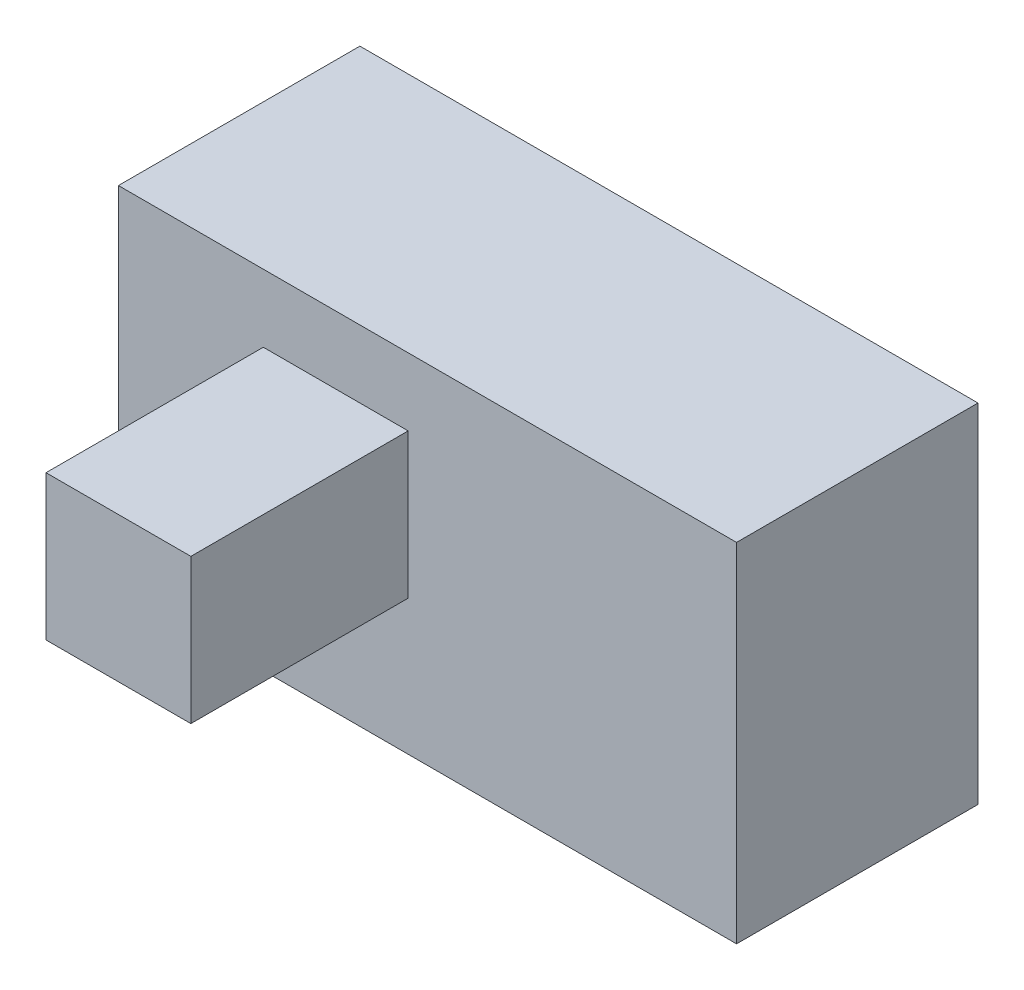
from build123d import *

# Parameters (mm, degrees)
ESQUISSE1_W          = 12.8
ESQUISSE1_H          = 7.2
BASE_EXTRUSION_DEPTH = 5
ESQUISSE2_W          = 3
ESQUISSE2_H          = 3
BOSS_EXTRU_1_DEPTH   = 4.5
ESQUISSE3_R          = 0.25


with BuildPart() as part:
    # Esquisse1 → Base-Extrusion (new body)
    with BuildSketch(Plane.XY):
        with Locations((6.4, 3.6)):
            Rectangle(ESQUISSE1_W, ESQUISSE1_H)
    extrude(amount=BASE_EXTRUSION_DEPTH)

    # Esquisse2 → Boss.-Extru.1 (add)
    with BuildSketch(Plane.XY.offset(5)):
        with Locations((4.5, 4.3)):
            Rectangle(ESQUISSE2_W, ESQUISSE2_H)
    extrude(amount=BOSS_EXTRU_1_DEPTH)

    # Boss.-Balayage1: sweep along a path in Esquisse6
    with BuildLine(Plane(origin=(5.55, 0, 0), x_dir=(0, 0, -1), z_dir=(1, 0, 0))) as boss_balayage1_path:
        Line((0, 3.6), (2.580884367, 3.6))
    # Esquisse3 → Boss.-Balayage1 (sweep)
    with BuildSketch(Plane(origin=(0, 0, 0), x_dir=(-1, 0, 0), z_dir=(0, 0, -1))):
        with Locations((-6.4, 3.6)):
            Circle(ESQUISSE3_R)
    boss_balayage1 = sweep(path=boss_balayage1_path.line)

    # Sym_trie1: Boss.-Balayage1 across plane
    add(boss_balayage1.mirror(Plane(origin=(6.82, 0, 0), x_dir=(0, 0, 1), z_dir=(1, 0, 0))))

    # Sym_trie3: Boss.-Balayage1 across plane
    add(boss_balayage1.mirror(Plane(origin=(4.28, 0, 0), x_dir=(0, 0, 1), z_dir=(1, 0, 0))))


solid = part.part
